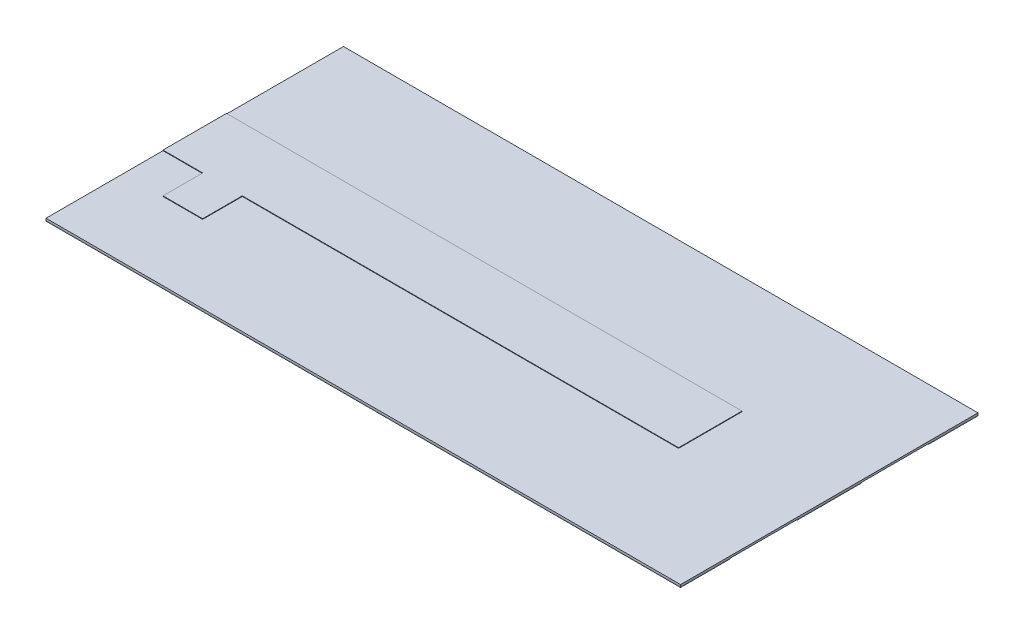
from build123d import *

# Parameters (mm, degrees)
SKETCH1_W             = 40.64
SKETCH1_H             = 19.05
BOSS_EXTRUDE1_DEPTH   = 0.127
BOSS_EXTRUDE2_DEPTH   = 0.03556
SKETCH4_W             = 23.241
SKETCH4_H             = 4.064
BOSS_EXTRUDE3_DEPTH   = 0.03556
SKETCH8_W             = 40.64
SKETCH8_H             = 3.175
BOSS_EXTRUDE5_DEPTH   = 0.03556
BOSS_EXTRUDE5_2_DEPTH = 0.03556
SKETCH9_W             = 2.54
SKETCH9_H             = 2.54
BOSS_EXTRUDE6_DEPTH   = 0.03556


with BuildPart() as part:
    # Sketch1 → Boss-Extrude1 (new body)
    with BuildSketch(Plane(origin=(0, 0, 0), x_dir=(1, 0, 0), z_dir=(0, 1, 0))):
        Rectangle(SKETCH1_W, SKETCH1_H)
    extrude(amount=BOSS_EXTRUDE1_DEPTH)



with BuildPart() as body_2:
    # Sketch3 → Boss-Extrude2 (new body)
    with BuildSketch(Plane(origin=(0, 0.127, 0), x_dir=(1, 0, 0), z_dir=(0, 1, 0))):
        Polygon((-20.32, 0), (-20.32, 2.032), (12.7, 2.032), (12.7, -2.032), (-20.32, -2.032), align=None)
    extrude(amount=BOSS_EXTRUDE2_DEPTH)


with BuildPart() as body_3:
    # Sketch4 → Boss-Extrude3 (new body)
    with BuildSketch(Plane.XZ):
        with Locations((8.6995, 0)):
            Rectangle(SKETCH4_W, SKETCH4_H)
    extrude(amount=BOSS_EXTRUDE3_DEPTH)


with BuildPart() as body_4:
    # Sketch8 → Boss-Extrude5 (new body)
    with BuildSketch(Plane.XZ):
        with Locations((0, 7.9375)):
            Rectangle(SKETCH8_W, SKETCH8_H)
    extrude(amount=BOSS_EXTRUDE5_DEPTH)


with BuildPart() as body_5:
    # Sketch8 → Boss-Extrude5 2 (new body)
    with BuildSketch(Plane.XZ):
        with Locations((0, -7.9375)):
            Rectangle(SKETCH8_W, SKETCH8_H)
    extrude(amount=BOSS_EXTRUDE5_2_DEPTH)


with BuildPart() as part_1:
    add(part.part)

    add(body_2.part)  # Boss-Extrude6 merges body 2
    # Sketch9 → Boss-Extrude6 (add)
    with BuildSketch(Plane(origin=(0, 0.127, 0), x_dir=(1, 0, 0), z_dir=(0, 1, 0))):
        with Locations((-16.51, -3.302)):
            Rectangle(SKETCH9_W, SKETCH9_H)
    extrude(amount=BOSS_EXTRUDE6_DEPTH)


solid = Compound([body_3.part, body_4.part, body_5.part, part_1.part])
